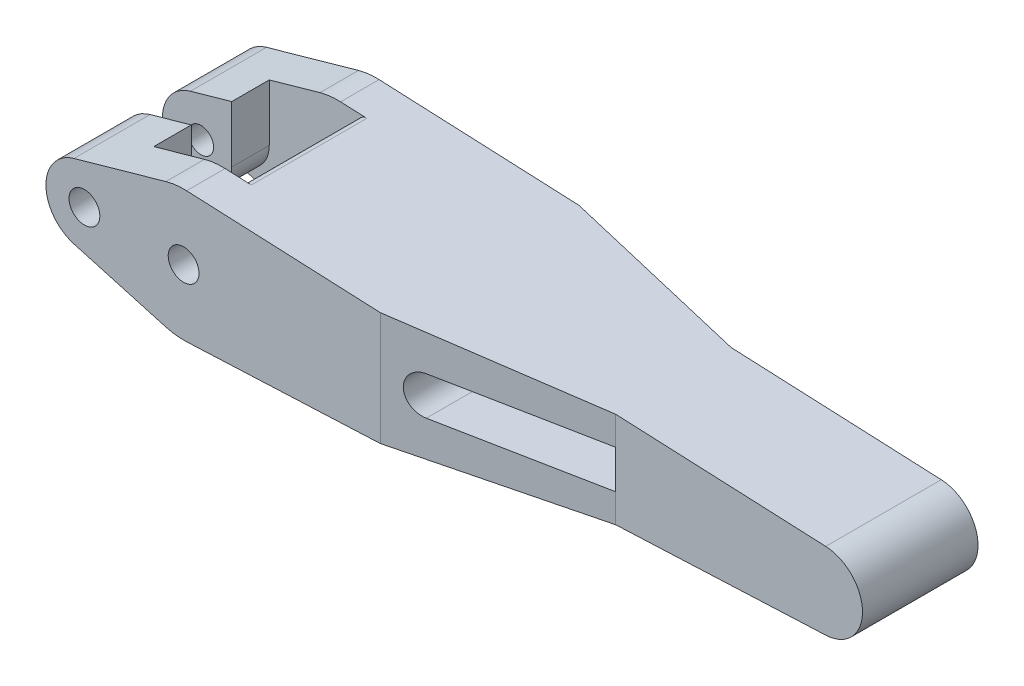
ISO-10303-21;
HEADER;
FILE_DESCRIPTION(('STEP AP214'),'2;1');
FILE_NAME('part.step','',(''),(''),'','','');
FILE_SCHEMA(('AUTOMOTIVE_DESIGN { 1 0 10303 214 1 1 1 1 }'));
ENDSEC;
DATA;
#1=APPLICATION_CONTEXT('core data for automotive mechanical design processes');
#2=APPLICATION_PROTOCOL_DEFINITION('international standard','automotive_design',2000,#1);
#3=PRODUCT_CONTEXT('',#1,'mechanical');
#4=PRODUCT('Part','Part','',(#3));
#5=PRODUCT_RELATED_PRODUCT_CATEGORY('part','',(#4));
#6=PRODUCT_DEFINITION_FORMATION('','',#4);
#7=PRODUCT_DEFINITION_CONTEXT('part definition',#1,'design');
#8=PRODUCT_DEFINITION('design','',#6,#7);
#9=PRODUCT_DEFINITION_SHAPE('','',#8);
#10=(LENGTH_UNIT() NAMED_UNIT(*) SI_UNIT(.MILLI.,.METRE.));
#11=(NAMED_UNIT(*) PLANE_ANGLE_UNIT() SI_UNIT($,.RADIAN.));
#12=(NAMED_UNIT(*) SI_UNIT($,.STERADIAN.) SOLID_ANGLE_UNIT());
#13=UNCERTAINTY_MEASURE_WITH_UNIT(LENGTH_MEASURE(1.E-05),#10,'distance_accuracy_value','');
#14=(GEOMETRIC_REPRESENTATION_CONTEXT(3) GLOBAL_UNCERTAINTY_ASSIGNED_CONTEXT((#13)) GLOBAL_UNIT_ASSIGNED_CONTEXT((#10,
#11,#12)) REPRESENTATION_CONTEXT('',''));
#15=CARTESIAN_POINT('',(0.,0.,0.));
#16=DIRECTION('',(0.,0.,1.));
#17=DIRECTION('',(1.,0.,0.));
#18=AXIS2_PLACEMENT_3D('',#15,#16,#17);
#19=CARTESIAN_POINT('',(-12.8769,-4.53211957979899E-09,15.125));
#20=DIRECTION('',(0.,0.,1.));
#21=DIRECTION('',(1.,0.,0.));
#22=AXIS2_PLACEMENT_3D('',#19,#20,#21);
#23=PLANE('',#22);
#24=CARTESIAN_POINT('',(-12.8769,-4.53211957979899E-09,15.125));
#25=DIRECTION('',(0.,0.,-1.));
#26=DIRECTION('',(1.,0.,0.));
#27=AXIS2_PLACEMENT_3D('',#24,#25,#26);
#28=CIRCLE('',#27,5.00000000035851);
#29=CARTESIAN_POINT('',(-14.2359227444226,-4.81176238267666,15.125));
#30=VERTEX_POINT('',#29);
#31=CARTESIAN_POINT('',(-14.2359227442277,4.81176237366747,15.125));
#32=VERTEX_POINT('',#31);
#33=EDGE_CURVE('E392',#30,#32,#28,.T.);
#34=ORIENTED_EDGE('',*,*,#33,.T.);
#35=DIRECTION('',(0.962432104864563,0.271522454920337,0.));
#36=VECTOR('',#35,1.);
#37=CARTESIAN_POINT('',(-8.87690000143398,6.32365604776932,15.125));
#38=LINE('',#37,#36);
#39=CARTESIAN_POINT('',(-8.87690000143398,6.32365604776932,15.125));
#40=VERTEX_POINT('',#39);
#41=EDGE_CURVE('E395',#32,#40,#38,.T.);
#42=ORIENTED_EDGE('',*,*,#41,.T.);
#43=DIRECTION('',(0.,-1.,0.));
#44=VECTOR('',#43,1.);
#45=CARTESIAN_POINT('',(-8.87690000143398,-1.03912031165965,15.125));
#46=LINE('',#45,#44);
#47=CARTESIAN_POINT('',(-8.87690000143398,-1.03912031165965,15.125));
#48=VERTEX_POINT('',#47);
#49=EDGE_CURVE('E398',#40,#48,#46,.T.);
#50=ORIENTED_EDGE('',*,*,#49,.T.);
#51=CARTESIAN_POINT('',(-12.876900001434,-1.03912031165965,15.125));
#52=DIRECTION('',(0.,0.,-1.));
#53=DIRECTION('',(1.,0.,0.));
#54=AXIS2_PLACEMENT_3D('',#51,#52,#53);
#55=CIRCLE('',#54,4.);
#56=CARTESIAN_POINT('',(-13.9641181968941,-4.88853021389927,15.125));
#57=VERTEX_POINT('',#56);
#58=EDGE_CURVE('E400',#48,#57,#55,.T.);
#59=ORIENTED_EDGE('',*,*,#58,.T.);
#60=DIRECTION('',(-0.96235247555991,0.271804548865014,0.));
#61=VECTOR('',#60,1.);
#62=CARTESIAN_POINT('',(-14.2359227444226,-4.81176238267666,15.125));
#63=LINE('',#62,#61);
#64=EDGE_CURVE('E402',#57,#30,#63,.T.);
#65=ORIENTED_EDGE('',*,*,#64,.T.);
#66=EDGE_LOOP('',(#34,#42,#50,#59,#65));
#67=FACE_BOUND('',#66,.T.);
#68=CARTESIAN_POINT('',(-12.8769,-4.90464309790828E-09,15.125));
#69=DIRECTION('',(0.,0.,-1.));
#70=DIRECTION('',(-1.,0.,0.));
#71=AXIS2_PLACEMENT_3D('',#68,#69,#70);
#72=CIRCLE('',#71,2.00000000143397);
#73=CARTESIAN_POINT('',(-14.876900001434,-4.90464309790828E-09,15.125));
#74=VERTEX_POINT('',#73);
#75=EDGE_CURVE('E783',#74,#74,#72,.T.);
#76=ORIENTED_EDGE('',*,*,#75,.F.);
#77=EDGE_LOOP('',(#76));
#78=FACE_BOUND('',#77,.T.);
#79=ADVANCED_FACE('F42',(#67,#78),#23,.F.);
#80=CARTESIAN_POINT('',(-8.87690000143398,25.,5.));
#81=DIRECTION('',(0.,0.,1.));
#82=DIRECTION('',(1.,0.,0.));
#83=AXIS2_PLACEMENT_3D('',#80,#81,#82);
#84=PLANE('',#83);
#85=CARTESIAN_POINT('',(0.,0.,5.));
#86=DIRECTION('',(0.,0.,1.));
#87=DIRECTION('',(1.,0.,0.));
#88=AXIS2_PLACEMENT_3D('',#85,#86,#87);
#89=CIRCLE('',#88,1.64999999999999);
#90=CARTESIAN_POINT('',(1.64999999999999,0.,5.));
#91=VERTEX_POINT('',#90);
#92=EDGE_CURVE('E790',#91,#91,#89,.T.);
#93=ORIENTED_EDGE('',*,*,#92,.F.);
#94=EDGE_LOOP('',(#93));
#95=FACE_BOUND('',#94,.T.);
#96=DIRECTION('',(-0.998996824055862,0.0447810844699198,0.));
#97=VECTOR('',#96,1.);
#98=CARTESIAN_POINT('',(36.5271466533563,6.87116775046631,4.99999999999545));
#99=LINE('',#98,#97);
#100=CARTESIAN_POINT('',(0.392183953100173,8.49095549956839,4.99999999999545));
#101=VERTEX_POINT('',#100);
#102=CARTESIAN_POINT('',(3.79121091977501,8.338590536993,4.99999999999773));
#103=VERTEX_POINT('',#102);
#104=EDGE_CURVE('E593',#101,#103,#99,.F.);
#105=ORIENTED_EDGE('',*,*,#104,.F.);
#106=CARTESIAN_POINT('',(0.0115447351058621,-0.000517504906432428,5.));
#107=DIRECTION('',(0.,0.,1.));
#108=DIRECTION('',(1.,0.,0.));
#109=AXIS2_PLACEMENT_3D('',#106,#107,#108);
#110=CIRCLE('',#109,8.5);
#111=CARTESIAN_POINT('',(-2.29639613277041,8.18015538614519,5.));
#112=VERTEX_POINT('',#111);
#113=EDGE_CURVE('E658',#101,#112,#110,.T.);
#114=ORIENTED_EDGE('',*,*,#113,.T.);
#115=DIRECTION('',(-0.962432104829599,-0.271522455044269,0.));
#116=VECTOR('',#115,1.);
#117=CARTESIAN_POINT('',(-2.06780801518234,8.24464492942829,5.));
#118=LINE('',#117,#116);
#119=CARTESIAN_POINT('',(-8.87690000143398,6.32365604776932,5.));
#120=VERTEX_POINT('',#119);
#121=EDGE_CURVE('E496',#112,#120,#118,.T.);
#122=ORIENTED_EDGE('',*,*,#121,.T.);
#123=DIRECTION('',(0.,1.,0.));
#124=VECTOR('',#123,1.);
#125=CARTESIAN_POINT('',(-8.87690000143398,6.32365604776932,5.));
#126=LINE('',#125,#124);
#127=CARTESIAN_POINT('',(-8.87690000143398,-1.03912031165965,5.));
#128=VERTEX_POINT('',#127);
#129=EDGE_CURVE('E369',#128,#120,#126,.T.);
#130=ORIENTED_EDGE('',*,*,#129,.F.);
#131=CARTESIAN_POINT('',(-12.876900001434,-1.03912031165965,5.));
#132=DIRECTION('',(0.,0.,1.));
#133=DIRECTION('',(-1.,0.,0.));
#134=AXIS2_PLACEMENT_3D('',#131,#132,#133);
#135=CIRCLE('',#134,4.);
#136=CARTESIAN_POINT('',(-13.9641181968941,-4.88853021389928,5.));
#137=VERTEX_POINT('',#136);
#138=EDGE_CURVE('E364',#137,#128,#135,.T.);
#139=ORIENTED_EDGE('',*,*,#138,.F.);
#140=DIRECTION('',(0.962352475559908,-0.271804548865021,0.));
#141=VECTOR('',#140,1.);
#142=CARTESIAN_POINT('',(-13.9641181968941,-4.88853021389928,5.));
#143=LINE('',#142,#141);
#144=CARTESIAN_POINT('',(-2.31033875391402,-8.17999601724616,5.));
#145=VERTEX_POINT('',#144);
#146=EDGE_CURVE('E490',#137,#145,#143,.T.);
#147=ORIENTED_EDGE('',*,*,#146,.T.);
#148=CARTESIAN_POINT('',(-8.85613388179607E-08,2.50130417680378E-08,5.));
#149=DIRECTION('',(0.,0.,1.));
#150=DIRECTION('',(1.,0.,0.));
#151=AXIS2_PLACEMENT_3D('',#148,#149,#150);
#152=CIRCLE('',#151,8.5);
#153=CARTESIAN_POINT('',(0.381340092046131,-8.49144152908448,5.));
#154=VERTEX_POINT('',#153);
#155=EDGE_CURVE('E752',#145,#154,#152,.T.);
#156=ORIENTED_EDGE('',*,*,#155,.T.);
#157=DIRECTION('',(0.998993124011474,0.0448635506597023,0.));
#158=VECTOR('',#157,1.);
#159=CARTESIAN_POINT('',(0.380639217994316,-8.49147300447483,5.));
#160=LINE('',#159,#158);
#161=CARTESIAN_POINT('',(23.3419328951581,-7.4603095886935,5.));
#162=VERTEX_POINT('',#161);
#163=EDGE_CURVE('E680',#154,#162,#160,.T.);
#164=ORIENTED_EDGE('',*,*,#163,.T.);
#165=CARTESIAN_POINT('',(23.2970693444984,-6.46131646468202,4.99999999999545));
#166=DIRECTION('',(0.,0.,1.));
#167=DIRECTION('',(1.,0.,0.));
#168=AXIS2_PLACEMENT_3D('',#165,#166,#167);
#169=CIRCLE('',#168,1.);
#170=CARTESIAN_POINT('',(22.720373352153,-7.27827529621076,5.));
#171=VERTEX_POINT('',#170);
#172=EDGE_CURVE('E770',#162,#171,#169,.F.);
#173=ORIENTED_EDGE('',*,*,#172,.T.);
#174=DIRECTION('',(-0.816958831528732,0.576695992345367,0.));
#175=VECTOR('',#174,1.);
#176=CARTESIAN_POINT('',(22.720373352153,-7.27827529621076,5.));
#177=LINE('',#176,#175);
#178=CARTESIAN_POINT('',(3.16973384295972,6.52263488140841,4.99999999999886));
#179=VERTEX_POINT('',#178);
#180=EDGE_CURVE('E696',#171,#179,#177,.T.);
#181=ORIENTED_EDGE('',*,*,#180,.T.);
#182=CARTESIAN_POINT('',(3.74642983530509,7.33959371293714,5.));
#183=DIRECTION('',(0.,0.,-1.));
#184=DIRECTION('',(-1.,0.,0.));
#185=AXIS2_PLACEMENT_3D('',#182,#183,#184);
#186=CIRCLE('',#185,1.);
#187=EDGE_CURVE('E645',#179,#103,#186,.T.);
#188=ORIENTED_EDGE('',*,*,#187,.T.);
#189=EDGE_LOOP('',(#105,#114,#122,#130,#139,#147,#156,#164,#173,#181,#188));
#190=FACE_BOUND('',#189,.T.);
#191=ADVANCED_FACE('F757',(#95,#190),#84,.T.);
#192=CARTESIAN_POINT('',(-8.87690000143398,25.,20.));
#193=DIRECTION('',(0.,0.,-1.));
#194=DIRECTION('',(-1.,0.,0.));
#195=AXIS2_PLACEMENT_3D('',#192,#193,#194);
#196=PLANE('',#195);
#197=CARTESIAN_POINT('',(0.,0.,20.));
#198=DIRECTION('',(0.,0.,-1.));
#199=DIRECTION('',(-1.,0.,0.));
#200=AXIS2_PLACEMENT_3D('',#197,#198,#199);
#201=CIRCLE('',#200,1.99999999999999);
#202=CARTESIAN_POINT('',(-1.99999999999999,0.,20.));
#203=VERTEX_POINT('',#202);
#204=EDGE_CURVE('E784',#203,#203,#201,.T.);
#205=ORIENTED_EDGE('',*,*,#204,.F.);
#206=EDGE_LOOP('',(#205));
#207=FACE_BOUND('',#206,.T.);
#208=DIRECTION('',(0.962432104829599,0.271522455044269,0.));
#209=VECTOR('',#208,1.);
#210=CARTESIAN_POINT('',(-8.87690000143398,6.32365604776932,20.));
#211=LINE('',#210,#209);
#212=CARTESIAN_POINT('',(-8.87690000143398,6.32365604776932,20.));
#213=VERTEX_POINT('',#212);
#214=CARTESIAN_POINT('',(-2.29639613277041,8.18015538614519,20.));
#215=VERTEX_POINT('',#214);
#216=EDGE_CURVE('E450',#213,#215,#211,.T.);
#217=ORIENTED_EDGE('',*,*,#216,.T.);
#218=CARTESIAN_POINT('',(0.0115447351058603,-0.000517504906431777,20.));
#219=DIRECTION('',(0.,0.,-1.));
#220=DIRECTION('',(-1.,0.,0.));
#221=AXIS2_PLACEMENT_3D('',#218,#219,#220);
#222=CIRCLE('',#221,8.5);
#223=CARTESIAN_POINT('',(0.392183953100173,8.49095549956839,20.));
#224=VERTEX_POINT('',#223);
#225=EDGE_CURVE('E667',#215,#224,#222,.T.);
#226=ORIENTED_EDGE('',*,*,#225,.T.);
#227=DIRECTION('',(-0.998996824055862,0.0447810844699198,0.));
#228=VECTOR('',#227,1.);
#229=CARTESIAN_POINT('',(36.5271466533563,6.87116775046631,20.));
#230=LINE('',#229,#228);
#231=CARTESIAN_POINT('',(3.79121091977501,8.338590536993,20.));
#232=VERTEX_POINT('',#231);
#233=EDGE_CURVE('E592',#232,#224,#230,.T.);
#234=ORIENTED_EDGE('',*,*,#233,.F.);
#235=CARTESIAN_POINT('',(3.74642983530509,7.33959371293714,20.));
#236=DIRECTION('',(0.,0.,-1.));
#237=DIRECTION('',(-1.,0.,0.));
#238=AXIS2_PLACEMENT_3D('',#235,#236,#237);
#239=CIRCLE('',#238,1.);
#240=CARTESIAN_POINT('',(3.16973384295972,6.52263488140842,19.9999999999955));
#241=VERTEX_POINT('',#240);
#242=EDGE_CURVE('E570',#232,#241,#239,.F.);
#243=ORIENTED_EDGE('',*,*,#242,.T.);
#244=DIRECTION('',(0.816958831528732,-0.576695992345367,0.));
#245=VECTOR('',#244,1.);
#246=CARTESIAN_POINT('',(3.16973384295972,6.52263488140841,20.));
#247=LINE('',#246,#245);
#248=CARTESIAN_POINT('',(22.720373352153,-7.27827529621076,20.));
#249=VERTEX_POINT('',#248);
#250=EDGE_CURVE('E716',#241,#249,#247,.T.);
#251=ORIENTED_EDGE('',*,*,#250,.T.);
#252=CARTESIAN_POINT('',(23.2970693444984,-6.46131646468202,19.9999999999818));
#253=DIRECTION('',(0.,0.,-1.));
#254=DIRECTION('',(-1.,0.,0.));
#255=AXIS2_PLACEMENT_3D('',#252,#253,#254);
#256=CIRCLE('',#255,1.);
#257=CARTESIAN_POINT('',(23.3419328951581,-7.4603095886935,20.));
#258=VERTEX_POINT('',#257);
#259=EDGE_CURVE('E771',#249,#258,#256,.F.);
#260=ORIENTED_EDGE('',*,*,#259,.T.);
#261=DIRECTION('',(-0.998993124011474,-0.0448635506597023,0.));
#262=VECTOR('',#261,1.);
#263=CARTESIAN_POINT('',(23.3419328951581,-7.4603095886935,20.));
#264=LINE('',#263,#262);
#265=CARTESIAN_POINT('',(0.381340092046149,-8.49144152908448,20.));
#266=VERTEX_POINT('',#265);
#267=EDGE_CURVE('E629',#258,#266,#264,.T.);
#268=ORIENTED_EDGE('',*,*,#267,.T.);
#269=CARTESIAN_POINT('',(-8.85613249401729E-08,2.50130402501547E-08,20.));
#270=DIRECTION('',(0.,0.,-1.));
#271=DIRECTION('',(-1.,0.,0.));
#272=AXIS2_PLACEMENT_3D('',#269,#270,#271);
#273=CIRCLE('',#272,8.5);
#274=CARTESIAN_POINT('',(-2.31033875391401,-8.17999601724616,20.));
#275=VERTEX_POINT('',#274);
#276=EDGE_CURVE('E57',#266,#275,#273,.T.);
#277=ORIENTED_EDGE('',*,*,#276,.T.);
#278=DIRECTION('',(-0.962352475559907,0.271804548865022,0.));
#279=VECTOR('',#278,1.);
#280=CARTESIAN_POINT('',(-2.31033866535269,-8.17999604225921,20.));
#281=LINE('',#280,#279);
#282=CARTESIAN_POINT('',(-13.9641181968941,-4.88853021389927,20.));
#283=VERTEX_POINT('',#282);
#284=EDGE_CURVE('E625',#275,#283,#281,.T.);
#285=ORIENTED_EDGE('',*,*,#284,.T.);
#286=CARTESIAN_POINT('',(-12.876900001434,-1.03912031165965,20.));
#287=DIRECTION('',(0.,0.,-1.));
#288=DIRECTION('',(1.,0.,0.));
#289=AXIS2_PLACEMENT_3D('',#286,#287,#288);
#290=CIRCLE('',#289,4.);
#291=CARTESIAN_POINT('',(-8.87690000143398,-1.03912031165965,20.));
#292=VERTEX_POINT('',#291);
#293=EDGE_CURVE('E396',#292,#283,#290,.T.);
#294=ORIENTED_EDGE('',*,*,#293,.F.);
#295=DIRECTION('',(0.,-1.,0.));
#296=VECTOR('',#295,1.);
#297=CARTESIAN_POINT('',(-8.87690000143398,-1.03912031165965,20.));
#298=LINE('',#297,#296);
#299=EDGE_CURVE('E391',#213,#292,#298,.T.);
#300=ORIENTED_EDGE('',*,*,#299,.F.);
#301=EDGE_LOOP('',(#217,#226,#234,#243,#251,#260,#268,#277,#285,#294,#300));
#302=FACE_BOUND('',#301,.T.);
#303=ADVANCED_FACE('F859',(#207,#302),#196,.T.);
#304=CARTESIAN_POINT('',(32.640549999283,-79.8328002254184,0.));
#305=DIRECTION('',(0.,0.,1.));
#306=DIRECTION('',(1.,0.,0.));
#307=AXIS2_PLACEMENT_3D('',#304,#305,#306);
#308=PLANE('',#307);
#309=CARTESIAN_POINT('',(-12.8769,-4.90464309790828E-09,0.));
#310=DIRECTION('',(0.,0.,-1.));
#311=DIRECTION('',(-1.,0.,0.));
#312=AXIS2_PLACEMENT_3D('',#309,#310,#311);
#313=CIRCLE('',#312,1.64999999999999);
#314=CARTESIAN_POINT('',(-14.5269,-4.90464309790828E-09,0.));
#315=VERTEX_POINT('',#314);
#316=EDGE_CURVE('E787',#315,#315,#313,.T.);
#317=ORIENTED_EDGE('',*,*,#316,.F.);
#318=EDGE_LOOP('',(#317));
#319=FACE_BOUND('',#318,.T.);
#320=CARTESIAN_POINT('',(0.,0.,0.));
#321=DIRECTION('',(0.,0.,1.));
#322=DIRECTION('',(1.,0.,0.));
#323=AXIS2_PLACEMENT_3D('',#320,#321,#322);
#324=CIRCLE('',#323,1.64999999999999);
#325=CARTESIAN_POINT('',(1.64999999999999,0.,0.));
#326=VERTEX_POINT('',#325);
#327=EDGE_CURVE('E788',#326,#326,#324,.T.);
#328=ORIENTED_EDGE('',*,*,#327,.T.);
#329=EDGE_LOOP('',(#328));
#330=FACE_BOUND('',#329,.T.);
#331=DIRECTION('',(-0.962432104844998,-0.271522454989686,0.));
#332=VECTOR('',#331,1.);
#333=CARTESIAN_POINT('',(-2.06780801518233,8.24464492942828,0.));
#334=LINE('',#333,#332);
#335=CARTESIAN_POINT('',(-2.29639613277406,8.18015538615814,0.));
#336=VERTEX_POINT('',#335);
#337=CARTESIAN_POINT('',(-14.2359227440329,4.81176237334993,0.));
#338=VERTEX_POINT('',#337);
#339=EDGE_CURVE('E705',#336,#338,#334,.T.);
#340=ORIENTED_EDGE('',*,*,#339,.F.);
#341=CARTESIAN_POINT('',(0.0115447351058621,-0.000517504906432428,0.));
#342=DIRECTION('',(0.,0.,1.));
#343=DIRECTION('',(1.,0.,0.));
#344=AXIS2_PLACEMENT_3D('',#341,#342,#343);
#345=CIRCLE('',#344,8.5);
#346=CARTESIAN_POINT('',(0.392183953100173,8.49095549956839,0.));
#347=VERTEX_POINT('',#346);
#348=EDGE_CURVE('E748',#336,#347,#345,.F.);
#349=ORIENTED_EDGE('',*,*,#348,.T.);
#350=DIRECTION('',(-0.998996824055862,0.0447810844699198,0.));
#351=VECTOR('',#350,1.);
#352=CARTESIAN_POINT('',(36.5271466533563,6.87116775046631,0.));
#353=LINE('',#352,#351);
#354=CARTESIAN_POINT('',(26.3320520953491,7.32817359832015,0.));
#355=VERTEX_POINT('',#354);
#356=EDGE_CURVE('E717',#355,#347,#353,.T.);
#357=ORIENTED_EDGE('',*,*,#356,.F.);
#358=DIRECTION('',(0.,1.,0.));
#359=VECTOR('',#358,1.);
#360=CARTESIAN_POINT('',(26.3320520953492,-79.8328002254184,0.));
#361=LINE('',#360,#359);
#362=CARTESIAN_POINT('',(26.3320520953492,-7.32602701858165,0.));
#363=VERTEX_POINT('',#362);
#364=EDGE_CURVE('E472',#363,#355,#361,.T.);
#365=ORIENTED_EDGE('',*,*,#364,.F.);
#366=DIRECTION('',(0.998993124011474,0.0448635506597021,0.));
#367=VECTOR('',#366,1.);
#368=CARTESIAN_POINT('',(0.380639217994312,-8.49147300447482,0.));
#369=LINE('',#368,#367);
#370=CARTESIAN_POINT('',(0.381340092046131,-8.49144152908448,0.));
#371=VERTEX_POINT('',#370);
#372=EDGE_CURVE('E536',#371,#363,#369,.T.);
#373=ORIENTED_EDGE('',*,*,#372,.F.);
#374=CARTESIAN_POINT('',(-8.85613388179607E-08,2.50130417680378E-08,0.));
#375=DIRECTION('',(0.,0.,1.));
#376=DIRECTION('',(1.,0.,0.));
#377=AXIS2_PLACEMENT_3D('',#374,#375,#376);
#378=CIRCLE('',#377,8.5);
#379=CARTESIAN_POINT('',(-2.31033875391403,-8.17999601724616,0.));
#380=VERTEX_POINT('',#379);
#381=EDGE_CURVE('E688',#371,#380,#378,.F.);
#382=ORIENTED_EDGE('',*,*,#381,.T.);
#383=DIRECTION('',(0.962352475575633,-0.271804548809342,0.));
#384=VECTOR('',#383,1.);
#385=CARTESIAN_POINT('',(-14.23592274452,-4.81176238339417,0.));
#386=LINE('',#385,#384);
#387=CARTESIAN_POINT('',(-14.2359227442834,-4.8117623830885,0.));
#388=VERTEX_POINT('',#387);
#389=EDGE_CURVE('E530',#388,#380,#386,.T.);
#390=ORIENTED_EDGE('',*,*,#389,.F.);
#391=CARTESIAN_POINT('',(-12.8769,-4.90464309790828E-09,0.));
#392=DIRECTION('',(0.,0.,-1.));
#393=DIRECTION('',(-1.,0.,0.));
#394=AXIS2_PLACEMENT_3D('',#391,#392,#393);
#395=CIRCLE('',#394,5.00000000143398);
#396=EDGE_CURVE('E698',#338,#388,#395,.F.);
#397=ORIENTED_EDGE('',*,*,#396,.F.);
#398=EDGE_LOOP('',(#340,#349,#357,#365,#373,#382,#390,#397));
#399=FACE_BOUND('',#398,.T.);
#400=ADVANCED_FACE('F686',(#319,#330,#399),#308,.F.);
#401=CARTESIAN_POINT('',(7.06512784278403,10.8212393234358,25.));
#402=DIRECTION('',(-0.271522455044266,0.9624321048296,0.));
#403=DIRECTION('',(-0.9624321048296,-0.271522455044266,0.));
#404=AXIS2_PLACEMENT_3D('',#401,#402,#403);
#405=PLANE('',#404);
#406=DIRECTION('',(-0.962432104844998,-0.271522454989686,0.));
#407=VECTOR('',#406,1.);
#408=CARTESIAN_POINT('',(-2.06780801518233,8.24464492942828,25.));
#409=LINE('',#408,#407);
#410=CARTESIAN_POINT('',(-2.29639613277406,8.18015538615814,25.));
#411=VERTEX_POINT('',#410);
#412=CARTESIAN_POINT('',(-14.2359227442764,4.81176237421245,25.));
#413=VERTEX_POINT('',#412);
#414=EDGE_CURVE('E606',#411,#413,#409,.T.);
#415=ORIENTED_EDGE('',*,*,#414,.F.);
#416=DIRECTION('',(0.,0.,1.));
#417=VECTOR('',#416,1.);
#418=CARTESIAN_POINT('',(-2.2963961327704,8.18015538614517,25.));
#419=LINE('',#418,#417);
#420=EDGE_CURVE('E664',#411,#215,#419,.F.);
#421=ORIENTED_EDGE('',*,*,#420,.T.);
#422=ORIENTED_EDGE('',*,*,#216,.F.);
#423=DIRECTION('',(0.,0.,1.));
#424=VECTOR('',#423,1.);
#425=CARTESIAN_POINT('',(-8.87690000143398,6.32365604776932,15.125));
#426=LINE('',#425,#424);
#427=EDGE_CURVE('E415',#40,#213,#426,.T.);
#428=ORIENTED_EDGE('',*,*,#427,.F.);
#429=ORIENTED_EDGE('',*,*,#41,.F.);
#430=DIRECTION('',(0.,0.,-1.));
#431=VECTOR('',#430,1.);
#432=CARTESIAN_POINT('',(-14.2359227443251,4.81176237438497,25.));
#433=LINE('',#432,#431);
#434=EDGE_CURVE('E641',#413,#32,#433,.T.);
#435=ORIENTED_EDGE('',*,*,#434,.F.);
#436=EDGE_LOOP('',(#415,#421,#422,#428,#429,#435));
#437=FACE_BOUND('',#436,.T.);
#438=ADVANCED_FACE('F891',(#437),#405,.T.);
#439=CARTESIAN_POINT('',(-12.8769,-4.90464309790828E-09,25.));
#440=DIRECTION('',(0.,0.,-1.));
#441=DIRECTION('',(-1.,0.,0.));
#442=AXIS2_PLACEMENT_3D('',#439,#440,#441);
#443=CYLINDRICAL_SURFACE('',#442,5.00000000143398);
#444=ORIENTED_EDGE('',*,*,#434,.T.);
#445=ORIENTED_EDGE('',*,*,#33,.F.);
#446=DIRECTION('',(0.,0.,1.));
#447=VECTOR('',#446,1.);
#448=CARTESIAN_POINT('',(-14.23592274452,-4.81176238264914,25.));
#449=LINE('',#448,#447);
#450=CARTESIAN_POINT('',(-14.2359227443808,-4.81176238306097,25.));
#451=VERTEX_POINT('',#450);
#452=EDGE_CURVE('E637',#30,#451,#449,.T.);
#453=ORIENTED_EDGE('',*,*,#452,.T.);
#454=CARTESIAN_POINT('',(-12.8769,-4.90464309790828E-09,25.));
#455=DIRECTION('',(0.,0.,-1.));
#456=DIRECTION('',(-1.,0.,0.));
#457=AXIS2_PLACEMENT_3D('',#454,#455,#456);
#458=CIRCLE('',#457,5.00000000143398);
#459=EDGE_CURVE('E610',#413,#451,#458,.F.);
#460=ORIENTED_EDGE('',*,*,#459,.F.);
#461=EDGE_LOOP('',(#444,#445,#453,#460));
#462=FACE_BOUND('',#461,.T.);
#463=ADVANCED_FACE('F922',(#462),#443,.T.);
#464=CARTESIAN_POINT('',(48.8008098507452,-22.6157075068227,25.));
#465=DIRECTION('',(0.271804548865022,0.962352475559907,0.));
#466=DIRECTION('',(-0.962352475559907,0.271804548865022,0.));
#467=AXIS2_PLACEMENT_3D('',#464,#465,#466);
#468=PLANE('',#467);
#469=ORIENTED_EDGE('',*,*,#284,.F.);
#470=DIRECTION('',(0.,0.,1.));
#471=VECTOR('',#470,1.);
#472=CARTESIAN_POINT('',(-2.31033875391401,-8.17999601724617,25.));
#473=LINE('',#472,#471);
#474=CARTESIAN_POINT('',(-2.31033875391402,-8.17999601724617,25.));
#475=VERTEX_POINT('',#474);
#476=EDGE_CURVE('E669',#275,#475,#473,.T.);
#477=ORIENTED_EDGE('',*,*,#476,.T.);
#478=DIRECTION('',(0.962352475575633,-0.271804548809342,0.));
#479=VECTOR('',#478,1.);
#480=CARTESIAN_POINT('',(-14.23592274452,-4.81176238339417,25.));
#481=LINE('',#480,#479);
#482=EDGE_CURVE('E611',#451,#475,#481,.T.);
#483=ORIENTED_EDGE('',*,*,#482,.F.);
#484=ORIENTED_EDGE('',*,*,#452,.F.);
#485=ORIENTED_EDGE('',*,*,#64,.F.);
#486=DIRECTION('',(0.,0.,1.));
#487=VECTOR('',#486,1.);
#488=CARTESIAN_POINT('',(-13.9641181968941,-4.88853021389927,15.125));
#489=LINE('',#488,#487);
#490=EDGE_CURVE('E405',#57,#283,#489,.T.);
#491=ORIENTED_EDGE('',*,*,#490,.T.);
#492=EDGE_LOOP('',(#469,#477,#483,#484,#485,#491));
#493=FACE_BOUND('',#492,.T.);
#494=ADVANCED_FACE('F919',(#493),#468,.F.);
#495=CARTESIAN_POINT('',(-12.8769,-4.90464309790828E-09,25.));
#496=DIRECTION('',(0.,0.,-1.));
#497=DIRECTION('',(-1.,0.,0.));
#498=AXIS2_PLACEMENT_3D('',#495,#496,#497);
#499=CYLINDRICAL_SURFACE('',#498,5.00000000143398);
#500=DIRECTION('',(0.,0.,1.));
#501=VECTOR('',#500,1.);
#502=CARTESIAN_POINT('',(-14.2359227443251,-4.81176238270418,25.));
#503=LINE('',#502,#501);
#504=CARTESIAN_POINT('',(-14.2359227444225,-4.81176238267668,9.875));
#505=VERTEX_POINT('',#504);
#506=EDGE_CURVE('E565',#388,#505,#503,.T.);
#507=ORIENTED_EDGE('',*,*,#506,.T.);
#508=CARTESIAN_POINT('',(-12.8769,-4.53213421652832E-09,9.875));
#509=DIRECTION('',(0.,0.,1.));
#510=DIRECTION('',(-1.,0.,0.));
#511=AXIS2_PLACEMENT_3D('',#508,#509,#510);
#512=CIRCLE('',#511,5.00000000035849);
#513=CARTESIAN_POINT('',(-14.2359227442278,4.81176237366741,9.875));
#514=VERTEX_POINT('',#513);
#515=EDGE_CURVE('E365',#514,#505,#512,.T.);
#516=ORIENTED_EDGE('',*,*,#515,.F.);
#517=DIRECTION('',(0.,0.,1.));
#518=VECTOR('',#517,1.);
#519=CARTESIAN_POINT('',(-14.2359227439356,4.8117623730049,25.));
#520=LINE('',#519,#518);
#521=EDGE_CURVE('E571',#338,#514,#520,.T.);
#522=ORIENTED_EDGE('',*,*,#521,.F.);
#523=ORIENTED_EDGE('',*,*,#396,.T.);
#524=EDGE_LOOP('',(#507,#516,#522,#523));
#525=FACE_BOUND('',#524,.T.);
#526=ADVANCED_FACE('F835',(#525),#499,.T.);
#527=CARTESIAN_POINT('',(7.06512784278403,10.8212393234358,25.));
#528=DIRECTION('',(-0.271522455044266,0.9624321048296,0.));
#529=DIRECTION('',(-0.9624321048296,-0.271522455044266,0.));
#530=AXIS2_PLACEMENT_3D('',#527,#528,#529);
#531=PLANE('',#530);
#532=ORIENTED_EDGE('',*,*,#121,.F.);
#533=DIRECTION('',(0.,0.,-1.));
#534=VECTOR('',#533,1.);
#535=CARTESIAN_POINT('',(-2.2963961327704,8.18015538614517,25.));
#536=LINE('',#535,#534);
#537=EDGE_CURVE('E764',#112,#336,#536,.T.);
#538=ORIENTED_EDGE('',*,*,#537,.T.);
#539=ORIENTED_EDGE('',*,*,#339,.T.);
#540=ORIENTED_EDGE('',*,*,#521,.T.);
#541=DIRECTION('',(-0.962432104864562,-0.271522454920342,0.));
#542=VECTOR('',#541,1.);
#543=CARTESIAN_POINT('',(-14.2359227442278,4.81176237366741,9.875));
#544=LINE('',#543,#542);
#545=CARTESIAN_POINT('',(-8.87690000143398,6.32365604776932,9.875));
#546=VERTEX_POINT('',#545);
#547=EDGE_CURVE('E375',#546,#514,#544,.T.);
#548=ORIENTED_EDGE('',*,*,#547,.F.);
#549=DIRECTION('',(0.,0.,-1.));
#550=VECTOR('',#549,1.);
#551=CARTESIAN_POINT('',(-8.87690000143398,6.32365604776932,9.875));
#552=LINE('',#551,#550);
#553=EDGE_CURVE('E378',#546,#120,#552,.T.);
#554=ORIENTED_EDGE('',*,*,#553,.T.);
#555=EDGE_LOOP('',(#532,#538,#539,#540,#548,#554));
#556=FACE_BOUND('',#555,.T.);
#557=ADVANCED_FACE('F763',(#556),#531,.T.);
#558=CARTESIAN_POINT('',(48.8008098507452,-22.6157075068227,25.));
#559=DIRECTION('',(0.271804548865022,0.962352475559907,0.));
#560=DIRECTION('',(-0.962352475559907,0.271804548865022,0.));
#561=AXIS2_PLACEMENT_3D('',#558,#559,#560);
#562=PLANE('',#561);
#563=ORIENTED_EDGE('',*,*,#389,.T.);
#564=DIRECTION('',(0.,0.,-1.));
#565=VECTOR('',#564,1.);
#566=CARTESIAN_POINT('',(-2.31033875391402,-8.17999601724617,25.));
#567=LINE('',#566,#565);
#568=EDGE_CURVE('E12',#380,#145,#567,.F.);
#569=ORIENTED_EDGE('',*,*,#568,.T.);
#570=ORIENTED_EDGE('',*,*,#146,.F.);
#571=DIRECTION('',(0.,0.,-1.));
#572=VECTOR('',#571,1.);
#573=CARTESIAN_POINT('',(-13.964118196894,-4.88853021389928,9.875));
#574=LINE('',#573,#572);
#575=CARTESIAN_POINT('',(-13.964118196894,-4.88853021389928,9.875));
#576=VERTEX_POINT('',#575);
#577=EDGE_CURVE('E388',#576,#137,#574,.T.);
#578=ORIENTED_EDGE('',*,*,#577,.F.);
#579=DIRECTION('',(0.96235247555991,-0.271804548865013,0.));
#580=VECTOR('',#579,1.);
#581=CARTESIAN_POINT('',(-13.964118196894,-4.88853021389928,9.875));
#582=LINE('',#581,#580);
#583=EDGE_CURVE('E368',#505,#576,#582,.T.);
#584=ORIENTED_EDGE('',*,*,#583,.F.);
#585=ORIENTED_EDGE('',*,*,#506,.F.);
#586=EDGE_LOOP('',(#563,#569,#570,#578,#584,#585));
#587=FACE_BOUND('',#586,.T.);
#588=ADVANCED_FACE('F838',(#587),#562,.F.);
#589=CARTESIAN_POINT('',(29.3782166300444,-7.18922752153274,25.));
#590=DIRECTION('',(-0.0448635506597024,0.998993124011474,0.));
#591=DIRECTION('',(-0.998993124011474,-0.0448635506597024,0.));
#592=AXIS2_PLACEMENT_3D('',#589,#590,#591);
#593=PLANE('',#592);
#594=DIRECTION('',(0.998993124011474,0.0448635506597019,0.));
#595=VECTOR('',#594,1.);
#596=CARTESIAN_POINT('',(0.380639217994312,-8.49147300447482,25.));
#597=LINE('',#596,#595);
#598=CARTESIAN_POINT('',(0.381340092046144,-8.49144152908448,25.));
#599=VERTEX_POINT('',#598);
#600=CARTESIAN_POINT('',(25.5398331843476,-7.36160459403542,25.));
#601=VERTEX_POINT('',#600);
#602=EDGE_CURVE('E654',#599,#601,#597,.T.);
#603=ORIENTED_EDGE('',*,*,#602,.F.);
#604=DIRECTION('',(0.,0.,1.));
#605=VECTOR('',#604,1.);
#606=CARTESIAN_POINT('',(0.381340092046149,-8.49144152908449,25.));
#607=LINE('',#606,#605);
#608=EDGE_CURVE('E50',#599,#266,#607,.F.);
#609=ORIENTED_EDGE('',*,*,#608,.T.);
#610=ORIENTED_EDGE('',*,*,#267,.F.);
#611=DIRECTION('',(0.,0.,1.));
#612=VECTOR('',#611,1.);
#613=CARTESIAN_POINT('',(23.3419328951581,-7.4603095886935,25.));
#614=LINE('',#613,#612);
#615=EDGE_CURVE('E776',#258,#162,#614,.F.);
#616=ORIENTED_EDGE('',*,*,#615,.T.);
#617=ORIENTED_EDGE('',*,*,#163,.F.);
#618=DIRECTION('',(0.,0.,-1.));
#619=VECTOR('',#618,1.);
#620=CARTESIAN_POINT('',(0.381340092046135,-8.49144152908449,25.));
#621=LINE('',#620,#619);
#622=EDGE_CURVE('E672',#154,#371,#621,.T.);
#623=ORIENTED_EDGE('',*,*,#622,.T.);
#624=ORIENTED_EDGE('',*,*,#372,.T.);
#625=DIRECTION('',(-0.979292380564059,-0.0439788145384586,-0.197616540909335));
#626=VECTOR('',#625,1.);
#627=CARTESIAN_POINT('',(51.1096434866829,-6.21329590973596,5.00000000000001));
#628=LINE('',#627,#626);
#629=CARTESIAN_POINT('',(51.1096434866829,-6.21329590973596,5.));
#630=VERTEX_POINT('',#629);
#631=EDGE_CURVE('E481',#630,#363,#628,.T.);
#632=ORIENTED_EDGE('',*,*,#631,.F.);
#633=DIRECTION('',(0.998993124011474,0.0448635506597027,0.));
#634=VECTOR('',#633,1.);
#635=CARTESIAN_POINT('',(51.1096434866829,-6.21329590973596,5.));
#636=LINE('',#635,#634);
#637=CARTESIAN_POINT('',(78.6355695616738,-4.97714047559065,5.));
#638=VERTEX_POINT('',#637);
#639=EDGE_CURVE('E423',#630,#638,#636,.T.);
#640=ORIENTED_EDGE('',*,*,#639,.T.);
#641=DIRECTION('',(0.,0.,-1.));
#642=VECTOR('',#641,1.);
#643=CARTESIAN_POINT('',(78.6355695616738,-4.97714047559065,25.));
#644=LINE('',#643,#642);
#645=CARTESIAN_POINT('',(78.6355695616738,-4.97714047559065,20.));
#646=VERTEX_POINT('',#645);
#647=EDGE_CURVE('E578',#646,#638,#644,.T.);
#648=ORIENTED_EDGE('',*,*,#647,.F.);
#649=DIRECTION('',(-0.998993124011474,-0.0448635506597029,0.));
#650=VECTOR('',#649,1.);
#651=CARTESIAN_POINT('',(78.6355695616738,-4.97714047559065,20.));
#652=LINE('',#651,#650);
#653=CARTESIAN_POINT('',(51.1096434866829,-6.21329590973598,20.));
#654=VERTEX_POINT('',#653);
#655=EDGE_CURVE('E427',#646,#654,#652,.T.);
#656=ORIENTED_EDGE('',*,*,#655,.T.);
#657=DIRECTION('',(-0.980460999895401,-0.0440312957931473,0.191722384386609));
#658=VECTOR('',#657,1.);
#659=CARTESIAN_POINT('',(51.1096434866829,-6.21329590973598,20.));
#660=LINE('',#659,#658);
#661=EDGE_CURVE('E418',#654,#601,#660,.T.);
#662=ORIENTED_EDGE('',*,*,#661,.T.);
#663=EDGE_LOOP('',(#603,#609,#610,#616,#617,#623,#624,#632,#640,#648,#656,#662));
#664=FACE_BOUND('',#663,.T.);
#665=ADVANCED_FACE('F677',(#664),#593,.F.);
#666=CARTESIAN_POINT('',(23.,-7.47566537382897,-500000.));
#667=DIRECTION('',(0.576695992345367,0.816958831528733,0.));
#668=DIRECTION('',(-0.816958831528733,0.576695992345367,0.));
#669=AXIS2_PLACEMENT_3D('',#666,#667,#668);
#670=PLANE('',#669);
#671=ORIENTED_EDGE('',*,*,#180,.F.);
#672=DIRECTION('',(0.,0.,1.));
#673=VECTOR('',#672,1.);
#674=CARTESIAN_POINT('',(22.720373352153,-7.27827529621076,-500000.));
#675=LINE('',#674,#673);
#676=EDGE_CURVE('E727',#171,#249,#675,.T.);
#677=ORIENTED_EDGE('',*,*,#676,.T.);
#678=ORIENTED_EDGE('',*,*,#250,.F.);
#679=DIRECTION('',(0.,0.,1.));
#680=VECTOR('',#679,1.);
#681=CARTESIAN_POINT('',(3.16973384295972,6.52263488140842,-500000.));
#682=LINE('',#681,#680);
#683=EDGE_CURVE('E572',#179,#241,#682,.T.);
#684=ORIENTED_EDGE('',*,*,#683,.F.);
#685=EDGE_LOOP('',(#671,#677,#678,#684));
#686=FACE_BOUND('',#685,.T.);
#687=ADVANCED_FACE('F906',(#686),#670,.F.);
#688=CARTESIAN_POINT('',(3.74642983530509,7.33959371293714,25.));
#689=DIRECTION('',(0.,0.,-1.));
#690=DIRECTION('',(-1.,0.,0.));
#691=AXIS2_PLACEMENT_3D('',#688,#689,#690);
#692=CYLINDRICAL_SURFACE('',#691,1.);
#693=DIRECTION('',(0.,0.,1.));
#694=VECTOR('',#693,1.);
#695=CARTESIAN_POINT('',(3.79121091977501,8.338590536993,25.));
#696=LINE('',#695,#694);
#697=EDGE_CURVE('E495',#103,#232,#696,.T.);
#698=ORIENTED_EDGE('',*,*,#697,.F.);
#699=ORIENTED_EDGE('',*,*,#187,.F.);
#700=ORIENTED_EDGE('',*,*,#683,.T.);
#701=ORIENTED_EDGE('',*,*,#242,.F.);
#702=EDGE_LOOP('',(#698,#699,#700,#701));
#703=FACE_BOUND('',#702,.T.);
#704=ADVANCED_FACE('F899',(#703),#692,.T.);
#705=CARTESIAN_POINT('',(32.640549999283,-79.8328002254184,25.));
#706=DIRECTION('',(0.,0.,1.));
#707=DIRECTION('',(1.,0.,0.));
#708=AXIS2_PLACEMENT_3D('',#705,#706,#707);
#709=PLANE('',#708);
#710=CARTESIAN_POINT('',(0.,0.,25.));
#711=DIRECTION('',(0.,0.,1.));
#712=DIRECTION('',(1.,0.,0.));
#713=AXIS2_PLACEMENT_3D('',#710,#711,#712);
#714=CIRCLE('',#713,1.99999999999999);
#715=CARTESIAN_POINT('',(1.99999999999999,0.,25.));
#716=VERTEX_POINT('',#715);
#717=EDGE_CURVE('E780',#716,#716,#714,.T.);
#718=ORIENTED_EDGE('',*,*,#717,.F.);
#719=EDGE_LOOP('',(#718));
#720=FACE_BOUND('',#719,.T.);
#721=CARTESIAN_POINT('',(-12.8769,-4.90464309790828E-09,25.));
#722=DIRECTION('',(0.,0.,1.));
#723=DIRECTION('',(1.,0.,0.));
#724=AXIS2_PLACEMENT_3D('',#721,#722,#723);
#725=CIRCLE('',#724,2.00000000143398);
#726=CARTESIAN_POINT('',(-10.876899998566,-4.90464309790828E-09,25.));
#727=VERTEX_POINT('',#726);
#728=EDGE_CURVE('E785',#727,#727,#725,.T.);
#729=ORIENTED_EDGE('',*,*,#728,.F.);
#730=EDGE_LOOP('',(#729));
#731=FACE_BOUND('',#730,.T.);
#732=DIRECTION('',(-0.998996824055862,0.0447810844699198,0.));
#733=VECTOR('',#732,1.);
#734=CARTESIAN_POINT('',(36.5271466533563,6.87116775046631,25.));
#735=LINE('',#734,#733);
#736=CARTESIAN_POINT('',(0.392183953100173,8.49095549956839,25.));
#737=VERTEX_POINT('',#736);
#738=CARTESIAN_POINT('',(25.5398331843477,7.36368564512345,25.));
#739=VERTEX_POINT('',#738);
#740=EDGE_CURVE('E729',#737,#739,#735,.F.);
#741=ORIENTED_EDGE('',*,*,#740,.F.);
#742=CARTESIAN_POINT('',(0.0115447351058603,-0.000517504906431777,25.));
#743=DIRECTION('',(0.,0.,1.));
#744=DIRECTION('',(1.,0.,0.));
#745=AXIS2_PLACEMENT_3D('',#742,#743,#744);
#746=CIRCLE('',#745,8.5);
#747=EDGE_CURVE('E662',#737,#411,#746,.T.);
#748=ORIENTED_EDGE('',*,*,#747,.T.);
#749=ORIENTED_EDGE('',*,*,#414,.T.);
#750=ORIENTED_EDGE('',*,*,#459,.T.);
#751=ORIENTED_EDGE('',*,*,#482,.T.);
#752=CARTESIAN_POINT('',(-8.85613249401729E-08,2.50130402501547E-08,25.));
#753=DIRECTION('',(0.,0.,1.));
#754=DIRECTION('',(1.,0.,0.));
#755=AXIS2_PLACEMENT_3D('',#752,#753,#754);
#756=CIRCLE('',#755,8.5);
#757=EDGE_CURVE('E660',#475,#599,#756,.T.);
#758=ORIENTED_EDGE('',*,*,#757,.T.);
#759=ORIENTED_EDGE('',*,*,#602,.T.);
#760=DIRECTION('',(0.,1.,0.));
#761=VECTOR('',#760,1.);
#762=CARTESIAN_POINT('',(25.5398331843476,25.,25.));
#763=LINE('',#762,#761);
#764=EDGE_CURVE('E432',#601,#739,#763,.T.);
#765=ORIENTED_EDGE('',*,*,#764,.T.);
#766=EDGE_LOOP('',(#741,#748,#749,#750,#751,#758,#759,#765));
#767=FACE_BOUND('',#766,.T.);
#768=ADVANCED_FACE('F895',(#720,#731,#767),#709,.T.);
#769=CARTESIAN_POINT('',(78.158,0.,25.));
#770=DIRECTION('',(0.,0.,-1.));
#771=DIRECTION('',(-1.,0.,0.));
#772=AXIS2_PLACEMENT_3D('',#769,#770,#771);
#773=CYLINDRICAL_SURFACE('',#772,5.);
#774=CARTESIAN_POINT('',(78.158,0.,20.));
#775=DIRECTION('',(0.,0.,-1.));
#776=DIRECTION('',(-1.,0.,0.));
#777=AXIS2_PLACEMENT_3D('',#774,#775,#776);
#778=CIRCLE('',#777,5.);
#779=CARTESIAN_POINT('',(78.3819054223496,4.99498412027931,20.));
#780=VERTEX_POINT('',#779);
#781=EDGE_CURVE('E439',#780,#646,#778,.T.);
#782=ORIENTED_EDGE('',*,*,#781,.T.);
#783=ORIENTED_EDGE('',*,*,#647,.T.);
#784=CARTESIAN_POINT('',(78.158,0.,5.));
#785=DIRECTION('',(0.,0.,-1.));
#786=DIRECTION('',(-1.,0.,0.));
#787=AXIS2_PLACEMENT_3D('',#784,#785,#786);
#788=CIRCLE('',#787,5.);
#789=CARTESIAN_POINT('',(78.3819054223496,4.99498412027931,5.));
#790=VERTEX_POINT('',#789);
#791=EDGE_CURVE('E478',#638,#790,#788,.F.);
#792=ORIENTED_EDGE('',*,*,#791,.T.);
#793=DIRECTION('',(0.,0.,1.));
#794=VECTOR('',#793,1.);
#795=CARTESIAN_POINT('',(78.3819054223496,4.99498412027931,25.));
#796=LINE('',#795,#794);
#797=EDGE_CURVE('E720',#780,#790,#796,.F.);
#798=ORIENTED_EDGE('',*,*,#797,.F.);
#799=EDGE_LOOP('',(#782,#783,#792,#798));
#800=FACE_BOUND('',#799,.T.);
#801=ADVANCED_FACE('F887',(#800),#773,.T.);
#802=CARTESIAN_POINT('',(36.5271466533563,6.87116775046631,25.));
#803=DIRECTION('',(0.0447810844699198,0.998996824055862,0.));
#804=DIRECTION('',(-0.998996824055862,0.0447810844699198,0.));
#805=AXIS2_PLACEMENT_3D('',#802,#803,#804);
#806=PLANE('',#805);
#807=ORIENTED_EDGE('',*,*,#356,.T.);
#808=DIRECTION('',(0.,0.,-1.));
#809=VECTOR('',#808,1.);
#810=CARTESIAN_POINT('',(0.392183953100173,8.49095549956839,25.));
#811=LINE('',#810,#809);
#812=EDGE_CURVE('E751',#347,#101,#811,.F.);
#813=ORIENTED_EDGE('',*,*,#812,.T.);
#814=ORIENTED_EDGE('',*,*,#104,.T.);
#815=ORIENTED_EDGE('',*,*,#697,.T.);
#816=ORIENTED_EDGE('',*,*,#233,.T.);
#817=DIRECTION('',(0.,0.,1.));
#818=VECTOR('',#817,1.);
#819=CARTESIAN_POINT('',(0.392183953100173,8.49095549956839,25.));
#820=LINE('',#819,#818);
#821=EDGE_CURVE('E749',#224,#737,#820,.T.);
#822=ORIENTED_EDGE('',*,*,#821,.T.);
#823=ORIENTED_EDGE('',*,*,#740,.T.);
#824=DIRECTION('',(0.98046449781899,-0.043950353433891,-0.191723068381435));
#825=VECTOR('',#824,1.);
#826=CARTESIAN_POINT('',(25.5398331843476,7.36368564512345,25.));
#827=LINE('',#826,#825);
#828=CARTESIAN_POINT('',(51.1096434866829,6.21749197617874,20.));
#829=VERTEX_POINT('',#828);
#830=EDGE_CURVE('E424',#739,#829,#827,.T.);
#831=ORIENTED_EDGE('',*,*,#830,.T.);
#832=DIRECTION('',(-0.998996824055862,0.0447810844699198,0.));
#833=VECTOR('',#832,1.);
#834=CARTESIAN_POINT('',(36.5271466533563,6.87116775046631,20.));
#835=LINE('',#834,#833);
#836=EDGE_CURVE('E419',#829,#780,#835,.F.);
#837=ORIENTED_EDGE('',*,*,#836,.T.);
#838=ORIENTED_EDGE('',*,*,#797,.T.);
#839=DIRECTION('',(-0.998996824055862,0.0447810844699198,0.));
#840=VECTOR('',#839,1.);
#841=CARTESIAN_POINT('',(36.5271466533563,6.87116775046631,5.));
#842=LINE('',#841,#840);
#843=CARTESIAN_POINT('',(51.1096434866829,6.21749197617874,5.00000000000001));
#844=VERTEX_POINT('',#843);
#845=EDGE_CURVE('E465',#790,#844,#842,.T.);
#846=ORIENTED_EDGE('',*,*,#845,.T.);
#847=DIRECTION('',(-0.979295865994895,0.0438979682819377,-0.197617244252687));
#848=VECTOR('',#847,1.);
#849=CARTESIAN_POINT('',(51.1096434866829,6.21749197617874,5.));
#850=LINE('',#849,#848);
#851=EDGE_CURVE('E471',#844,#355,#850,.T.);
#852=ORIENTED_EDGE('',*,*,#851,.T.);
#853=EDGE_LOOP('',(#807,#813,#814,#815,#816,#822,#823,#831,#837,#838,#846,#852));
#854=FACE_BOUND('',#853,.T.);
#855=ADVANCED_FACE('F830',(#854),#806,.T.);
#856=CARTESIAN_POINT('',(-25.9174686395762,-25.,5.));
#857=DIRECTION('',(0.,0.,1.));
#858=DIRECTION('',(1.,0.,0.));
#859=AXIS2_PLACEMENT_3D('',#856,#857,#858);
#860=PLANE('',#859);
#861=DIRECTION('',(0.,1.,0.));
#862=VECTOR('',#861,1.);
#863=CARTESIAN_POINT('',(51.1096434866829,-25.,5.00000000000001));
#864=LINE('',#863,#862);
#865=CARTESIAN_POINT('',(51.1096434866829,-2.5,5.00000000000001));
#866=VERTEX_POINT('',#865);
#867=EDGE_CURVE('E309',#866,#630,#864,.F.);
#868=ORIENTED_EDGE('',*,*,#867,.F.);
#869=DIRECTION('',(1.,0.,0.));
#870=VECTOR('',#869,1.);
#871=CARTESIAN_POINT('',(31.3320520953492,-2.5,5.));
#872=LINE('',#871,#870);
#873=CARTESIAN_POINT('',(73.1563831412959,-2.5,5.));
#874=VERTEX_POINT('',#873);
#875=EDGE_CURVE('E301',#866,#874,#872,.T.);
#876=ORIENTED_EDGE('',*,*,#875,.T.);
#877=CARTESIAN_POINT('',(73.1563831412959,0.,5.));
#878=DIRECTION('',(0.,0.,-1.));
#879=DIRECTION('',(-1.,0.,0.));
#880=AXIS2_PLACEMENT_3D('',#877,#878,#879);
#881=CIRCLE('',#880,2.5);
#882=CARTESIAN_POINT('',(73.1563831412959,2.5,5.));
#883=VERTEX_POINT('',#882);
#884=EDGE_CURVE('E286',#874,#883,#881,.F.);
#885=ORIENTED_EDGE('',*,*,#884,.T.);
#886=DIRECTION('',(-1.,0.,0.));
#887=VECTOR('',#886,1.);
#888=CARTESIAN_POINT('',(73.1563831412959,2.5,5.));
#889=LINE('',#888,#887);
#890=CARTESIAN_POINT('',(51.1096434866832,2.5,5.00000000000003));
#891=VERTEX_POINT('',#890);
#892=EDGE_CURVE('E325',#883,#891,#889,.T.);
#893=ORIENTED_EDGE('',*,*,#892,.T.);
#894=EDGE_CURVE('E459',#844,#891,#864,.F.);
#895=ORIENTED_EDGE('',*,*,#894,.F.);
#896=ORIENTED_EDGE('',*,*,#845,.F.);
#897=ORIENTED_EDGE('',*,*,#791,.F.);
#898=ORIENTED_EDGE('',*,*,#639,.F.);
#899=EDGE_LOOP('',(#868,#876,#885,#893,#895,#896,#897,#898));
#900=FACE_BOUND('',#899,.T.);
#901=ADVANCED_FACE('F307',(#900),#860,.F.);
#902=CARTESIAN_POINT('',(-21.4784694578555,-25.,-9.64793566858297));
#903=DIRECTION('',(0.197807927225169,0.,-0.980240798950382));
#904=DIRECTION('',(-0.980240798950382,0.,-0.197807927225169));
#905=AXIS2_PLACEMENT_3D('',#902,#903,#904);
#906=PLANE('',#905);
#907=ORIENTED_EDGE('',*,*,#894,.T.);
#908=EDGE_CURVE('E455',#891,#866,#864,.F.);
#909=ORIENTED_EDGE('',*,*,#908,.T.);
#910=ORIENTED_EDGE('',*,*,#867,.T.);
#911=ORIENTED_EDGE('',*,*,#631,.T.);
#912=ORIENTED_EDGE('',*,*,#364,.T.);
#913=ORIENTED_EDGE('',*,*,#851,.F.);
#914=EDGE_LOOP('',(#907,#909,#910,#911,#912,#913));
#915=FACE_BOUND('',#914,.T.);
#916=ADVANCED_FACE('F814',(#915),#906,.T.);
#917=CARTESIAN_POINT('',(-21.6397603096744,25.,34.2256440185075));
#918=DIRECTION('',(-0.191908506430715,0.,-0.981412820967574));
#919=DIRECTION('',(-0.981412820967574,0.,0.191908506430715));
#920=AXIS2_PLACEMENT_3D('',#917,#918,#919);
#921=PLANE('',#920);
#922=DIRECTION('',(0.,1.,0.));
#923=VECTOR('',#922,1.);
#924=CARTESIAN_POINT('',(51.1096434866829,25.,20.));
#925=LINE('',#924,#923);
#926=CARTESIAN_POINT('',(51.1096434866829,-2.5,20.));
#927=VERTEX_POINT('',#926);
#928=EDGE_CURVE('E435',#654,#927,#925,.T.);
#929=ORIENTED_EDGE('',*,*,#928,.T.);
#930=DIRECTION('',(-0.981412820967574,0.,0.191908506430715));
#931=VECTOR('',#930,1.);
#932=CARTESIAN_POINT('',(63.2687537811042,-2.5,17.6223698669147));
#933=LINE('',#932,#931);
#934=CARTESIAN_POINT('',(30.5398331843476,-2.5,24.0222844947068));
#935=VERTEX_POINT('',#934);
#936=EDGE_CURVE('E335',#927,#935,#933,.T.);
#937=ORIENTED_EDGE('',*,*,#936,.T.);
#938=CARTESIAN_POINT('',(30.5398331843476,0.,24.0222844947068));
#939=DIRECTION('',(0.191908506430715,0.,0.981412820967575));
#940=DIRECTION('',(0.981412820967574,0.,-0.191908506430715));
#941=AXIS2_PLACEMENT_3D('',#938,#939,#940);
#942=ELLIPSE('',#941,2.54734801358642,2.5);
#943=CARTESIAN_POINT('',(30.5398331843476,2.5,24.0222844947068));
#944=VERTEX_POINT('',#943);
#945=EDGE_CURVE('E356',#935,#944,#942,.F.);
#946=ORIENTED_EDGE('',*,*,#945,.T.);
#947=DIRECTION('',(0.981412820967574,0.,-0.191908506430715));
#948=VECTOR('',#947,1.);
#949=CARTESIAN_POINT('',(22.2217234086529,2.5,25.6488334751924));
#950=LINE('',#949,#948);
#951=CARTESIAN_POINT('',(51.109643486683,2.5,20.));
#952=VERTEX_POINT('',#951);
#953=EDGE_CURVE('E352',#944,#952,#950,.T.);
#954=ORIENTED_EDGE('',*,*,#953,.T.);
#955=EDGE_CURVE('E431',#952,#829,#925,.T.);
#956=ORIENTED_EDGE('',*,*,#955,.T.);
#957=ORIENTED_EDGE('',*,*,#830,.F.);
#958=ORIENTED_EDGE('',*,*,#764,.F.);
#959=ORIENTED_EDGE('',*,*,#661,.F.);
#960=EDGE_LOOP('',(#929,#937,#946,#954,#956,#957,#958,#959));
#961=FACE_BOUND('',#960,.T.);
#962=ADVANCED_FACE('F875',(#961),#921,.F.);
#963=CARTESIAN_POINT('',(-25.9174686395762,25.,20.));
#964=DIRECTION('',(0.,0.,-1.));
#965=DIRECTION('',(-1.,0.,0.));
#966=AXIS2_PLACEMENT_3D('',#963,#964,#965);
#967=PLANE('',#966);
#968=ORIENTED_EDGE('',*,*,#928,.F.);
#969=ORIENTED_EDGE('',*,*,#655,.F.);
#970=ORIENTED_EDGE('',*,*,#781,.F.);
#971=ORIENTED_EDGE('',*,*,#836,.F.);
#972=ORIENTED_EDGE('',*,*,#955,.F.);
#973=EDGE_CURVE('E440',#927,#952,#925,.T.);
#974=ORIENTED_EDGE('',*,*,#973,.F.);
#975=EDGE_LOOP('',(#968,#969,#970,#971,#972,#974));
#976=FACE_BOUND('',#975,.T.);
#977=ADVANCED_FACE('F873',(#976),#967,.F.);
#978=CARTESIAN_POINT('',(-8.87690000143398,-1.03912031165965,15.125));
#979=DIRECTION('',(-1.,0.,0.));
#980=DIRECTION('',(0.,0.,1.));
#981=AXIS2_PLACEMENT_3D('',#978,#979,#980);
#982=PLANE('',#981);
#983=ORIENTED_EDGE('',*,*,#299,.T.);
#984=DIRECTION('',(0.,0.,1.));
#985=VECTOR('',#984,1.);
#986=CARTESIAN_POINT('',(-8.87690000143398,-1.03912031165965,15.125));
#987=LINE('',#986,#985);
#988=EDGE_CURVE('E412',#48,#292,#987,.T.);
#989=ORIENTED_EDGE('',*,*,#988,.F.);
#990=ORIENTED_EDGE('',*,*,#49,.F.);
#991=ORIENTED_EDGE('',*,*,#427,.T.);
#992=EDGE_LOOP('',(#983,#989,#990,#991));
#993=FACE_BOUND('',#992,.T.);
#994=ADVANCED_FACE('F869',(#993),#982,.F.);
#995=CARTESIAN_POINT('',(-12.876900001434,-1.03912031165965,15.125));
#996=DIRECTION('',(0.,0.,1.));
#997=DIRECTION('',(1.,0.,0.));
#998=AXIS2_PLACEMENT_3D('',#995,#996,#997);
#999=CYLINDRICAL_SURFACE('',#998,4.);
#1000=ORIENTED_EDGE('',*,*,#293,.T.);
#1001=ORIENTED_EDGE('',*,*,#490,.F.);
#1002=ORIENTED_EDGE('',*,*,#58,.F.);
#1003=ORIENTED_EDGE('',*,*,#988,.T.);
#1004=EDGE_LOOP('',(#1000,#1001,#1002,#1003));
#1005=FACE_BOUND('',#1004,.T.);
#1006=ADVANCED_FACE('F866',(#1005),#999,.T.);
#1007=CARTESIAN_POINT('',(-12.876900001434,-1.03912031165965,9.875));
#1008=DIRECTION('',(0.,0.,-1.));
#1009=DIRECTION('',(-1.,0.,0.));
#1010=AXIS2_PLACEMENT_3D('',#1007,#1008,#1009);
#1011=CYLINDRICAL_SURFACE('',#1010,4.);
#1012=ORIENTED_EDGE('',*,*,#138,.T.);
#1013=DIRECTION('',(0.,0.,-1.));
#1014=VECTOR('',#1013,1.);
#1015=CARTESIAN_POINT('',(-8.87690000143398,-1.03912031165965,9.875));
#1016=LINE('',#1015,#1014);
#1017=CARTESIAN_POINT('',(-8.87690000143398,-1.03912031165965,9.875));
#1018=VERTEX_POINT('',#1017);
#1019=EDGE_CURVE('E385',#1018,#128,#1016,.T.);
#1020=ORIENTED_EDGE('',*,*,#1019,.F.);
#1021=CARTESIAN_POINT('',(-12.876900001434,-1.03912031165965,9.875));
#1022=DIRECTION('',(0.,0.,1.));
#1023=DIRECTION('',(-1.,0.,0.));
#1024=AXIS2_PLACEMENT_3D('',#1021,#1022,#1023);
#1025=CIRCLE('',#1024,4.);
#1026=EDGE_CURVE('E371',#576,#1018,#1025,.T.);
#1027=ORIENTED_EDGE('',*,*,#1026,.F.);
#1028=ORIENTED_EDGE('',*,*,#577,.T.);
#1029=EDGE_LOOP('',(#1012,#1020,#1027,#1028));
#1030=FACE_BOUND('',#1029,.T.);
#1031=ADVANCED_FACE('F843',(#1030),#1011,.T.);
#1032=CARTESIAN_POINT('',(-8.87690000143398,6.32365604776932,9.875));
#1033=DIRECTION('',(-1.,0.,0.));
#1034=DIRECTION('',(0.,0.,1.));
#1035=AXIS2_PLACEMENT_3D('',#1032,#1033,#1034);
#1036=PLANE('',#1035);
#1037=ORIENTED_EDGE('',*,*,#129,.T.);
#1038=ORIENTED_EDGE('',*,*,#553,.F.);
#1039=DIRECTION('',(0.,1.,0.));
#1040=VECTOR('',#1039,1.);
#1041=CARTESIAN_POINT('',(-8.87690000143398,6.32365604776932,9.875));
#1042=LINE('',#1041,#1040);
#1043=EDGE_CURVE('E373',#1018,#546,#1042,.T.);
#1044=ORIENTED_EDGE('',*,*,#1043,.F.);
#1045=ORIENTED_EDGE('',*,*,#1019,.T.);
#1046=EDGE_LOOP('',(#1037,#1038,#1044,#1045));
#1047=FACE_BOUND('',#1046,.T.);
#1048=ADVANCED_FACE('F845',(#1047),#1036,.F.);
#1049=CARTESIAN_POINT('',(-12.8769,-4.53213421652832E-09,9.875));
#1050=DIRECTION('',(0.,0.,-1.));
#1051=DIRECTION('',(-1.,0.,0.));
#1052=AXIS2_PLACEMENT_3D('',#1049,#1050,#1051);
#1053=PLANE('',#1052);
#1054=CARTESIAN_POINT('',(-12.8769,-4.90464309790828E-09,9.875));
#1055=DIRECTION('',(0.,0.,-1.));
#1056=DIRECTION('',(-1.,0.,0.));
#1057=AXIS2_PLACEMENT_3D('',#1054,#1055,#1056);
#1058=CIRCLE('',#1057,1.64999999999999);
#1059=CARTESIAN_POINT('',(-14.5269,-4.90464309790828E-09,9.875));
#1060=VERTEX_POINT('',#1059);
#1061=EDGE_CURVE('E795',#1060,#1060,#1058,.T.);
#1062=ORIENTED_EDGE('',*,*,#1061,.T.);
#1063=EDGE_LOOP('',(#1062));
#1064=FACE_BOUND('',#1063,.T.);
#1065=ORIENTED_EDGE('',*,*,#515,.T.);
#1066=ORIENTED_EDGE('',*,*,#583,.T.);
#1067=ORIENTED_EDGE('',*,*,#1026,.T.);
#1068=ORIENTED_EDGE('',*,*,#1043,.T.);
#1069=ORIENTED_EDGE('',*,*,#547,.T.);
#1070=EDGE_LOOP('',(#1065,#1066,#1067,#1068,#1069));
#1071=FACE_BOUND('',#1070,.T.);
#1072=ADVANCED_FACE('F833',(#1064,#1071),#1053,.F.);
#1073=CARTESIAN_POINT('',(5.64914003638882,0.,28.8894878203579));
#1074=DIRECTION('',(0.191908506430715,0.,0.981412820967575));
#1075=DIRECTION('',(0.981412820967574,0.,-0.191908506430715));
#1076=AXIS2_PLACEMENT_3D('',#1073,#1074,#1075);
#1077=PLANE('',#1076);
#1078=CARTESIAN_POINT('',(73.1563831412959,2.5,15.6889121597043));
#1079=VERTEX_POINT('',#1078);
#1080=EDGE_CURVE('E355',#952,#1079,#950,.T.);
#1081=ORIENTED_EDGE('',*,*,#1080,.T.);
#1082=CARTESIAN_POINT('',(73.1563831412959,0.,15.6889121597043));
#1083=DIRECTION('',(0.191908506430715,0.,0.981412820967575));
#1084=DIRECTION('',(0.981412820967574,0.,-0.191908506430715));
#1085=AXIS2_PLACEMENT_3D('',#1082,#1083,#1084);
#1086=ELLIPSE('',#1085,2.54734801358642,2.5);
#1087=CARTESIAN_POINT('',(73.1563831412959,-2.5,15.6889121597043));
#1088=VERTEX_POINT('',#1087);
#1089=EDGE_CURVE('E347',#1079,#1088,#1086,.F.);
#1090=ORIENTED_EDGE('',*,*,#1089,.T.);
#1091=EDGE_CURVE('E344',#1088,#927,#933,.T.);
#1092=ORIENTED_EDGE('',*,*,#1091,.T.);
#1093=ORIENTED_EDGE('',*,*,#973,.T.);
#1094=EDGE_LOOP('',(#1081,#1090,#1092,#1093));
#1095=FACE_BOUND('',#1094,.T.);
#1096=ADVANCED_FACE('F1112',(#1095),#1077,.F.);
#1097=CARTESIAN_POINT('',(73.1563831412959,0.,15.));
#1098=DIRECTION('',(0.,0.,-1.));
#1099=DIRECTION('',(-1.,0.,0.));
#1100=AXIS2_PLACEMENT_3D('',#1097,#1098,#1099);
#1101=PLANE('',#1100);
#1102=CARTESIAN_POINT('',(73.1563831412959,0.,15.));
#1103=DIRECTION('',(0.,0.,-1.));
#1104=DIRECTION('',(-1.,0.,0.));
#1105=AXIS2_PLACEMENT_3D('',#1102,#1103,#1104);
#1106=CIRCLE('',#1105,2.5);
#1107=CARTESIAN_POINT('',(73.1563831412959,2.5,15.));
#1108=VERTEX_POINT('',#1107);
#1109=CARTESIAN_POINT('',(73.1563831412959,-2.5,15.));
#1110=VERTEX_POINT('',#1109);
#1111=EDGE_CURVE('E331',#1108,#1110,#1106,.T.);
#1112=ORIENTED_EDGE('',*,*,#1111,.F.);
#1113=DIRECTION('',(1.,0.,0.));
#1114=VECTOR('',#1113,1.);
#1115=CARTESIAN_POINT('',(30.5398331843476,2.5,15.));
#1116=LINE('',#1115,#1114);
#1117=CARTESIAN_POINT('',(30.5398331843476,2.5,15.));
#1118=VERTEX_POINT('',#1117);
#1119=EDGE_CURVE('E332',#1118,#1108,#1116,.T.);
#1120=ORIENTED_EDGE('',*,*,#1119,.F.);
#1121=CARTESIAN_POINT('',(30.5398331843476,0.,15.));
#1122=DIRECTION('',(0.,0.,-1.));
#1123=DIRECTION('',(-1.,0.,0.));
#1124=AXIS2_PLACEMENT_3D('',#1121,#1122,#1123);
#1125=CIRCLE('',#1124,2.5);
#1126=CARTESIAN_POINT('',(30.5398331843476,-2.5,15.));
#1127=VERTEX_POINT('',#1126);
#1128=EDGE_CURVE('E336',#1127,#1118,#1125,.T.);
#1129=ORIENTED_EDGE('',*,*,#1128,.F.);
#1130=DIRECTION('',(-1.,0.,0.));
#1131=VECTOR('',#1130,1.);
#1132=CARTESIAN_POINT('',(73.1563831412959,-2.5,15.));
#1133=LINE('',#1132,#1131);
#1134=EDGE_CURVE('E339',#1110,#1127,#1133,.T.);
#1135=ORIENTED_EDGE('',*,*,#1134,.F.);
#1136=EDGE_LOOP('',(#1112,#1120,#1129,#1135));
#1137=FACE_BOUND('',#1136,.T.);
#1138=ADVANCED_FACE('F1117',(#1137),#1101,.F.);
#1139=CARTESIAN_POINT('',(73.1563831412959,-2.5,68.1873312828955));
#1140=DIRECTION('',(0.,-1.,0.));
#1141=DIRECTION('',(1.,0.,0.));
#1142=AXIS2_PLACEMENT_3D('',#1139,#1140,#1141);
#1143=PLANE('',#1142);
#1144=DIRECTION('',(0.,0.,-1.));
#1145=VECTOR('',#1144,1.);
#1146=CARTESIAN_POINT('',(73.1563831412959,-2.5,68.1873312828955));
#1147=LINE('',#1146,#1145);
#1148=EDGE_CURVE('E350',#1088,#1110,#1147,.T.);
#1149=ORIENTED_EDGE('',*,*,#1148,.T.);
#1150=ORIENTED_EDGE('',*,*,#1134,.T.);
#1151=DIRECTION('',(0.,0.,-1.));
#1152=VECTOR('',#1151,1.);
#1153=CARTESIAN_POINT('',(30.5398331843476,-2.5,68.1873312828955));
#1154=LINE('',#1153,#1152);
#1155=EDGE_CURVE('E346',#935,#1127,#1154,.T.);
#1156=ORIENTED_EDGE('',*,*,#1155,.F.);
#1157=ORIENTED_EDGE('',*,*,#936,.F.);
#1158=ORIENTED_EDGE('',*,*,#1091,.F.);
#1159=EDGE_LOOP('',(#1149,#1150,#1156,#1157,#1158));
#1160=FACE_BOUND('',#1159,.T.);
#1161=ADVANCED_FACE('F1129',(#1160),#1143,.F.);
#1162=CARTESIAN_POINT('',(30.5398331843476,0.,68.1873312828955));
#1163=DIRECTION('',(0.,0.,-1.));
#1164=DIRECTION('',(-1.,0.,0.));
#1165=AXIS2_PLACEMENT_3D('',#1162,#1163,#1164);
#1166=CYLINDRICAL_SURFACE('',#1165,2.5);
#1167=ORIENTED_EDGE('',*,*,#1155,.T.);
#1168=ORIENTED_EDGE('',*,*,#1128,.T.);
#1169=DIRECTION('',(0.,0.,-1.));
#1170=VECTOR('',#1169,1.);
#1171=CARTESIAN_POINT('',(30.5398331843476,2.5,68.1873312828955));
#1172=LINE('',#1171,#1170);
#1173=EDGE_CURVE('E359',#944,#1118,#1172,.T.);
#1174=ORIENTED_EDGE('',*,*,#1173,.F.);
#1175=ORIENTED_EDGE('',*,*,#945,.F.);
#1176=EDGE_LOOP('',(#1167,#1168,#1174,#1175));
#1177=FACE_BOUND('',#1176,.T.);
#1178=ADVANCED_FACE('F1139',(#1177),#1166,.F.);
#1179=CARTESIAN_POINT('',(30.5398331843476,2.5,68.1873312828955));
#1180=DIRECTION('',(0.,1.,0.));
#1181=DIRECTION('',(0.,0.,1.));
#1182=AXIS2_PLACEMENT_3D('',#1179,#1180,#1181);
#1183=PLANE('',#1182);
#1184=ORIENTED_EDGE('',*,*,#1173,.T.);
#1185=ORIENTED_EDGE('',*,*,#1119,.T.);
#1186=DIRECTION('',(0.,0.,-1.));
#1187=VECTOR('',#1186,1.);
#1188=CARTESIAN_POINT('',(73.1563831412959,2.5,68.1873312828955));
#1189=LINE('',#1188,#1187);
#1190=EDGE_CURVE('E351',#1079,#1108,#1189,.T.);
#1191=ORIENTED_EDGE('',*,*,#1190,.F.);
#1192=ORIENTED_EDGE('',*,*,#1080,.F.);
#1193=ORIENTED_EDGE('',*,*,#953,.F.);
#1194=EDGE_LOOP('',(#1184,#1185,#1191,#1192,#1193));
#1195=FACE_BOUND('',#1194,.T.);
#1196=ADVANCED_FACE('F1149',(#1195),#1183,.F.);
#1197=CARTESIAN_POINT('',(73.1563831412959,0.,68.1873312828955));
#1198=DIRECTION('',(0.,0.,-1.));
#1199=DIRECTION('',(-1.,0.,0.));
#1200=AXIS2_PLACEMENT_3D('',#1197,#1198,#1199);
#1201=CYLINDRICAL_SURFACE('',#1200,2.5);
#1202=ORIENTED_EDGE('',*,*,#1190,.T.);
#1203=ORIENTED_EDGE('',*,*,#1111,.T.);
#1204=ORIENTED_EDGE('',*,*,#1148,.F.);
#1205=ORIENTED_EDGE('',*,*,#1089,.F.);
#1206=EDGE_LOOP('',(#1202,#1203,#1204,#1205));
#1207=FACE_BOUND('',#1206,.T.);
#1208=ADVANCED_FACE('F1159',(#1207),#1201,.F.);
#1209=CARTESIAN_POINT('',(0.,0.,5.));
#1210=DIRECTION('',(0.,0.,-1.));
#1211=DIRECTION('',(-1.,0.,0.));
#1212=AXIS2_PLACEMENT_3D('',#1209,#1210,#1211);
#1213=PLANE('',#1212);
#1214=ORIENTED_EDGE('',*,*,#908,.F.);
#1215=CARTESIAN_POINT('',(31.3320520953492,2.5,5.));
#1216=VERTEX_POINT('',#1215);
#1217=EDGE_CURVE('E326',#891,#1216,#889,.T.);
#1218=ORIENTED_EDGE('',*,*,#1217,.T.);
#1219=CARTESIAN_POINT('',(31.3320520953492,0.,5.));
#1220=DIRECTION('',(0.,0.,-1.));
#1221=DIRECTION('',(-1.,0.,0.));
#1222=AXIS2_PLACEMENT_3D('',#1219,#1220,#1221);
#1223=CIRCLE('',#1222,2.5);
#1224=CARTESIAN_POINT('',(31.3320520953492,-2.5,5.));
#1225=VERTEX_POINT('',#1224);
#1226=EDGE_CURVE('E320',#1216,#1225,#1223,.F.);
#1227=ORIENTED_EDGE('',*,*,#1226,.T.);
#1228=EDGE_CURVE('E305',#1225,#866,#872,.T.);
#1229=ORIENTED_EDGE('',*,*,#1228,.T.);
#1230=EDGE_LOOP('',(#1214,#1218,#1227,#1229));
#1231=FACE_BOUND('',#1230,.T.);
#1232=ADVANCED_FACE('F1169',(#1231),#1213,.F.);
#1233=CARTESIAN_POINT('',(31.3320520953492,0.,10.));
#1234=DIRECTION('',(0.,0.,1.));
#1235=DIRECTION('',(1.,0.,0.));
#1236=AXIS2_PLACEMENT_3D('',#1233,#1234,#1235);
#1237=PLANE('',#1236);
#1238=CARTESIAN_POINT('',(31.3320520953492,0.,10.));
#1239=DIRECTION('',(0.,0.,1.));
#1240=DIRECTION('',(1.,0.,0.));
#1241=AXIS2_PLACEMENT_3D('',#1238,#1239,#1240);
#1242=CIRCLE('',#1241,2.5);
#1243=CARTESIAN_POINT('',(31.3320520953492,2.5,10.));
#1244=VERTEX_POINT('',#1243);
#1245=CARTESIAN_POINT('',(31.3320520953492,-2.5,10.));
#1246=VERTEX_POINT('',#1245);
#1247=EDGE_CURVE('E318',#1244,#1246,#1242,.T.);
#1248=ORIENTED_EDGE('',*,*,#1247,.F.);
#1249=DIRECTION('',(-1.,0.,0.));
#1250=VECTOR('',#1249,1.);
#1251=CARTESIAN_POINT('',(73.1563831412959,2.5,10.));
#1252=LINE('',#1251,#1250);
#1253=CARTESIAN_POINT('',(73.1563831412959,2.5,10.));
#1254=VERTEX_POINT('',#1253);
#1255=EDGE_CURVE('E311',#1254,#1244,#1252,.T.);
#1256=ORIENTED_EDGE('',*,*,#1255,.F.);
#1257=CARTESIAN_POINT('',(73.1563831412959,0.,10.));
#1258=DIRECTION('',(0.,0.,1.));
#1259=DIRECTION('',(1.,0.,0.));
#1260=AXIS2_PLACEMENT_3D('',#1257,#1258,#1259);
#1261=CIRCLE('',#1260,2.5);
#1262=CARTESIAN_POINT('',(73.1563831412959,-2.5,10.));
#1263=VERTEX_POINT('',#1262);
#1264=EDGE_CURVE('E314',#1263,#1254,#1261,.T.);
#1265=ORIENTED_EDGE('',*,*,#1264,.F.);
#1266=DIRECTION('',(1.,0.,0.));
#1267=VECTOR('',#1266,1.);
#1268=CARTESIAN_POINT('',(31.3320520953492,-2.5,10.));
#1269=LINE('',#1268,#1267);
#1270=EDGE_CURVE('E304',#1246,#1263,#1269,.T.);
#1271=ORIENTED_EDGE('',*,*,#1270,.F.);
#1272=EDGE_LOOP('',(#1248,#1256,#1265,#1271));
#1273=FACE_BOUND('',#1272,.T.);
#1274=ADVANCED_FACE('F806',(#1273),#1237,.F.);
#1275=CARTESIAN_POINT('',(31.3320520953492,-2.5,-42.0905295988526));
#1276=DIRECTION('',(0.,-1.,0.));
#1277=DIRECTION('',(0.,0.,-1.));
#1278=AXIS2_PLACEMENT_3D('',#1275,#1276,#1277);
#1279=PLANE('',#1278);
#1280=DIRECTION('',(0.,0.,1.));
#1281=VECTOR('',#1280,1.);
#1282=CARTESIAN_POINT('',(31.3320520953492,-2.5,-42.0905295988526));
#1283=LINE('',#1282,#1281);
#1284=EDGE_CURVE('E323',#1225,#1246,#1283,.T.);
#1285=ORIENTED_EDGE('',*,*,#1284,.T.);
#1286=ORIENTED_EDGE('',*,*,#1270,.T.);
#1287=DIRECTION('',(0.,0.,1.));
#1288=VECTOR('',#1287,1.);
#1289=CARTESIAN_POINT('',(73.1563831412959,-2.5,-42.0905295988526));
#1290=LINE('',#1289,#1288);
#1291=EDGE_CURVE('E290',#874,#1263,#1290,.T.);
#1292=ORIENTED_EDGE('',*,*,#1291,.F.);
#1293=ORIENTED_EDGE('',*,*,#875,.F.);
#1294=ORIENTED_EDGE('',*,*,#1228,.F.);
#1295=EDGE_LOOP('',(#1285,#1286,#1292,#1293,#1294));
#1296=FACE_BOUND('',#1295,.T.);
#1297=ADVANCED_FACE('F300',(#1296),#1279,.F.);
#1298=CARTESIAN_POINT('',(73.1563831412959,0.,-42.0905295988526));
#1299=DIRECTION('',(0.,0.,1.));
#1300=DIRECTION('',(1.,0.,0.));
#1301=AXIS2_PLACEMENT_3D('',#1298,#1299,#1300);
#1302=CYLINDRICAL_SURFACE('',#1301,2.5);
#1303=ORIENTED_EDGE('',*,*,#1291,.T.);
#1304=ORIENTED_EDGE('',*,*,#1264,.T.);
#1305=DIRECTION('',(0.,0.,1.));
#1306=VECTOR('',#1305,1.);
#1307=CARTESIAN_POINT('',(73.1563831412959,2.5,-42.0905295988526));
#1308=LINE('',#1307,#1306);
#1309=EDGE_CURVE('E292',#883,#1254,#1308,.T.);
#1310=ORIENTED_EDGE('',*,*,#1309,.F.);
#1311=ORIENTED_EDGE('',*,*,#884,.F.);
#1312=EDGE_LOOP('',(#1303,#1304,#1310,#1311));
#1313=FACE_BOUND('',#1312,.T.);
#1314=ADVANCED_FACE('F288',(#1313),#1302,.F.);
#1315=CARTESIAN_POINT('',(73.1563831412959,2.5,-42.0905295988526));
#1316=DIRECTION('',(0.,1.,0.));
#1317=DIRECTION('',(-1.,0.,0.));
#1318=AXIS2_PLACEMENT_3D('',#1315,#1316,#1317);
#1319=PLANE('',#1318);
#1320=ORIENTED_EDGE('',*,*,#1309,.T.);
#1321=ORIENTED_EDGE('',*,*,#1255,.T.);
#1322=DIRECTION('',(0.,0.,1.));
#1323=VECTOR('',#1322,1.);
#1324=CARTESIAN_POINT('',(31.3320520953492,2.5,-42.0905295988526));
#1325=LINE('',#1324,#1323);
#1326=EDGE_CURVE('E324',#1216,#1244,#1325,.T.);
#1327=ORIENTED_EDGE('',*,*,#1326,.F.);
#1328=ORIENTED_EDGE('',*,*,#1217,.F.);
#1329=ORIENTED_EDGE('',*,*,#892,.F.);
#1330=EDGE_LOOP('',(#1320,#1321,#1327,#1328,#1329));
#1331=FACE_BOUND('',#1330,.T.);
#1332=ADVANCED_FACE('F809',(#1331),#1319,.F.);
#1333=CARTESIAN_POINT('',(31.3320520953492,0.,-42.0905295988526));
#1334=DIRECTION('',(0.,0.,1.));
#1335=DIRECTION('',(1.,0.,0.));
#1336=AXIS2_PLACEMENT_3D('',#1333,#1334,#1335);
#1337=CYLINDRICAL_SURFACE('',#1336,2.5);
#1338=ORIENTED_EDGE('',*,*,#1326,.T.);
#1339=ORIENTED_EDGE('',*,*,#1247,.T.);
#1340=ORIENTED_EDGE('',*,*,#1284,.F.);
#1341=ORIENTED_EDGE('',*,*,#1226,.F.);
#1342=EDGE_LOOP('',(#1338,#1339,#1340,#1341));
#1343=FACE_BOUND('',#1342,.T.);
#1344=ADVANCED_FACE('F1220',(#1343),#1337,.F.);
#1345=CARTESIAN_POINT('',(0.,0.,5.));
#1346=DIRECTION('',(0.,0.,1.));
#1347=DIRECTION('',(1.,0.,0.));
#1348=AXIS2_PLACEMENT_3D('',#1345,#1346,#1347);
#1349=CYLINDRICAL_SURFACE('',#1348,1.64999999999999);
#1350=ORIENTED_EDGE('',*,*,#92,.T.);
#1351=EDGE_LOOP('',(#1350));
#1352=FACE_BOUND('',#1351,.T.);
#1353=ORIENTED_EDGE('',*,*,#327,.F.);
#1354=EDGE_LOOP('',(#1353));
#1355=FACE_BOUND('',#1354,.T.);
#1356=ADVANCED_FACE('F1229',(#1352,#1355),#1349,.F.);
#1357=CARTESIAN_POINT('',(-12.8769,-4.90464309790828E-09,0.));
#1358=DIRECTION('',(0.,0.,-1.));
#1359=DIRECTION('',(-1.,0.,0.));
#1360=AXIS2_PLACEMENT_3D('',#1357,#1358,#1359);
#1361=CYLINDRICAL_SURFACE('',#1360,1.64999999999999);
#1362=ORIENTED_EDGE('',*,*,#1061,.F.);
#1363=EDGE_LOOP('',(#1362));
#1364=FACE_BOUND('',#1363,.T.);
#1365=ORIENTED_EDGE('',*,*,#316,.T.);
#1366=EDGE_LOOP('',(#1365));
#1367=FACE_BOUND('',#1366,.T.);
#1368=ADVANCED_FACE('F1239',(#1364,#1367),#1361,.F.);
#1369=CARTESIAN_POINT('',(-12.8769,-4.90464309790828E-09,15.125));
#1370=DIRECTION('',(0.,0.,-1.));
#1371=DIRECTION('',(-1.,0.,0.));
#1372=AXIS2_PLACEMENT_3D('',#1369,#1370,#1371);
#1373=CYLINDRICAL_SURFACE('',#1372,2.00000000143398);
#1374=ORIENTED_EDGE('',*,*,#728,.T.);
#1375=EDGE_LOOP('',(#1374));
#1376=FACE_BOUND('',#1375,.T.);
#1377=ORIENTED_EDGE('',*,*,#75,.T.);
#1378=EDGE_LOOP('',(#1377));
#1379=FACE_BOUND('',#1378,.T.);
#1380=ADVANCED_FACE('F1256',(#1376,#1379),#1373,.F.);
#1381=CARTESIAN_POINT('',(0.,0.,20.));
#1382=DIRECTION('',(0.,0.,-1.));
#1383=DIRECTION('',(-1.,0.,0.));
#1384=AXIS2_PLACEMENT_3D('',#1381,#1382,#1383);
#1385=CYLINDRICAL_SURFACE('',#1384,1.99999999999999);
#1386=ORIENTED_EDGE('',*,*,#717,.T.);
#1387=EDGE_LOOP('',(#1386));
#1388=FACE_BOUND('',#1387,.T.);
#1389=ORIENTED_EDGE('',*,*,#204,.T.);
#1390=EDGE_LOOP('',(#1389));
#1391=FACE_BOUND('',#1390,.T.);
#1392=ADVANCED_FACE('F933',(#1388,#1391),#1385,.F.);
#1393=CARTESIAN_POINT('',(23.2970693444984,-6.46131646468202,-500000.));
#1394=DIRECTION('',(0.,0.,1.));
#1395=DIRECTION('',(1.,0.,0.));
#1396=AXIS2_PLACEMENT_3D('',#1393,#1394,#1395);
#1397=CYLINDRICAL_SURFACE('',#1396,1.);
#1398=ORIENTED_EDGE('',*,*,#172,.F.);
#1399=ORIENTED_EDGE('',*,*,#615,.F.);
#1400=ORIENTED_EDGE('',*,*,#259,.F.);
#1401=ORIENTED_EDGE('',*,*,#676,.F.);
#1402=EDGE_LOOP('',(#1398,#1399,#1400,#1401));
#1403=FACE_BOUND('',#1402,.T.);
#1404=ADVANCED_FACE('F930',(#1403),#1397,.T.);
#1405=CARTESIAN_POINT('',(0.0115447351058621,-0.000517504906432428,25.));
#1406=DIRECTION('',(0.,0.,-1.));
#1407=DIRECTION('',(-1.,0.,0.));
#1408=AXIS2_PLACEMENT_3D('',#1405,#1406,#1407);
#1409=CYLINDRICAL_SURFACE('',#1408,8.5);
#1410=ORIENTED_EDGE('',*,*,#113,.F.);
#1411=ORIENTED_EDGE('',*,*,#812,.F.);
#1412=ORIENTED_EDGE('',*,*,#348,.F.);
#1413=ORIENTED_EDGE('',*,*,#537,.F.);
#1414=EDGE_LOOP('',(#1410,#1411,#1412,#1413));
#1415=FACE_BOUND('',#1414,.T.);
#1416=ADVANCED_FACE('F769',(#1415),#1409,.T.);
#1417=CARTESIAN_POINT('',(0.0115447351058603,-0.000517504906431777,25.));
#1418=DIRECTION('',(0.,0.,1.));
#1419=DIRECTION('',(1.,0.,0.));
#1420=AXIS2_PLACEMENT_3D('',#1417,#1418,#1419);
#1421=CYLINDRICAL_SURFACE('',#1420,8.5);
#1422=ORIENTED_EDGE('',*,*,#225,.F.);
#1423=ORIENTED_EDGE('',*,*,#420,.F.);
#1424=ORIENTED_EDGE('',*,*,#747,.F.);
#1425=ORIENTED_EDGE('',*,*,#821,.F.);
#1426=EDGE_LOOP('',(#1422,#1423,#1424,#1425));
#1427=FACE_BOUND('',#1426,.T.);
#1428=ADVANCED_FACE('F851',(#1427),#1421,.T.);
#1429=CARTESIAN_POINT('',(-8.85613249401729E-08,2.50130402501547E-08,25.));
#1430=DIRECTION('',(0.,0.,1.));
#1431=DIRECTION('',(1.,0.,0.));
#1432=AXIS2_PLACEMENT_3D('',#1429,#1430,#1431);
#1433=CYLINDRICAL_SURFACE('',#1432,8.5);
#1434=ORIENTED_EDGE('',*,*,#276,.F.);
#1435=ORIENTED_EDGE('',*,*,#608,.F.);
#1436=ORIENTED_EDGE('',*,*,#757,.F.);
#1437=ORIENTED_EDGE('',*,*,#476,.F.);
#1438=EDGE_LOOP('',(#1434,#1435,#1436,#1437));
#1439=FACE_BOUND('',#1438,.T.);
#1440=ADVANCED_FACE('F847',(#1439),#1433,.T.);
#1441=CARTESIAN_POINT('',(-8.85613388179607E-08,2.50130417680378E-08,25.));
#1442=DIRECTION('',(0.,0.,-1.));
#1443=DIRECTION('',(-1.,0.,0.));
#1444=AXIS2_PLACEMENT_3D('',#1441,#1442,#1443);
#1445=CYLINDRICAL_SURFACE('',#1444,8.5);
#1446=ORIENTED_EDGE('',*,*,#155,.F.);
#1447=ORIENTED_EDGE('',*,*,#568,.F.);
#1448=ORIENTED_EDGE('',*,*,#381,.F.);
#1449=ORIENTED_EDGE('',*,*,#622,.F.);
#1450=EDGE_LOOP('',(#1446,#1447,#1448,#1449));
#1451=FACE_BOUND('',#1450,.T.);
#1452=ADVANCED_FACE('F44',(#1451),#1445,.T.);
#1453=CLOSED_SHELL('',(#79,#191,#303,#400,#438,#463,#494,#526,#557,#588,#665,#687,#704,#768,
#801,#855,#901,#916,#962,#977,#994,#1006,#1031,#1048,#1072,#1096,#1138,#1161,#1178,#1196,#1208,
#1232,#1274,#1297,#1314,#1332,#1344,#1356,#1368,#1380,#1392,#1404,#1416,#1428,#1440,#1452));
#1454=MANIFOLD_SOLID_BREP('B2',#1453);
#1455=ADVANCED_BREP_SHAPE_REPRESENTATION('',(#18,#1454),#14);
#1456=SHAPE_DEFINITION_REPRESENTATION(#9,#1455);
ENDSEC;
END-ISO-10303-21;
